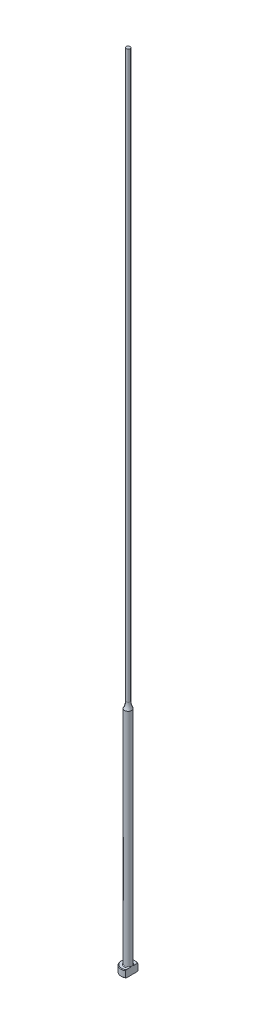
ISO-10303-21;
HEADER;
FILE_DESCRIPTION(('STEP AP214'),'2;1');
FILE_NAME('part.step','',(''),(''),'','','');
FILE_SCHEMA(('AUTOMOTIVE_DESIGN { 1 0 10303 214 1 1 1 1 }'));
ENDSEC;
DATA;
#1=APPLICATION_CONTEXT('core data for automotive mechanical design processes');
#2=APPLICATION_PROTOCOL_DEFINITION('international standard','automotive_design',2000,#1);
#3=PRODUCT_CONTEXT('',#1,'mechanical');
#4=PRODUCT('Part','Part','',(#3));
#5=PRODUCT_RELATED_PRODUCT_CATEGORY('part','',(#4));
#6=PRODUCT_DEFINITION_FORMATION('','',#4);
#7=PRODUCT_DEFINITION_CONTEXT('part definition',#1,'design');
#8=PRODUCT_DEFINITION('design','',#6,#7);
#9=PRODUCT_DEFINITION_SHAPE('','',#8);
#10=(LENGTH_UNIT() NAMED_UNIT(*) SI_UNIT(.MILLI.,.METRE.));
#11=(NAMED_UNIT(*) PLANE_ANGLE_UNIT() SI_UNIT($,.RADIAN.));
#12=(NAMED_UNIT(*) SI_UNIT($,.STERADIAN.) SOLID_ANGLE_UNIT());
#13=UNCERTAINTY_MEASURE_WITH_UNIT(LENGTH_MEASURE(1.E-05),#10,'distance_accuracy_value','');
#14=(GEOMETRIC_REPRESENTATION_CONTEXT(3) GLOBAL_UNCERTAINTY_ASSIGNED_CONTEXT((#13)) GLOBAL_UNIT_ASSIGNED_CONTEXT((#10,
#11,#12)) REPRESENTATION_CONTEXT('',''));
#15=CARTESIAN_POINT('',(0.,0.,0.));
#16=DIRECTION('',(0.,0.,1.));
#17=DIRECTION('',(1.,0.,0.));
#18=AXIS2_PLACEMENT_3D('',#15,#16,#17);
#19=CARTESIAN_POINT('',(-3.17499999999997,3.175,0.));
#20=DIRECTION('',(0.,1.,0.));
#21=DIRECTION('',(0.,0.,1.));
#22=AXIS2_PLACEMENT_3D('',#19,#20,#21);
#23=PLANE('',#22);
#24=CARTESIAN_POINT('',(0.,3.175,0.));
#25=DIRECTION('',(0.,1.,0.));
#26=DIRECTION('',(0.,0.,1.));
#27=AXIS2_PLACEMENT_3D('',#24,#25,#26);
#28=CIRCLE('',#27,2.92099999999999);
#29=CARTESIAN_POINT('',(1.58749999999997,3.175,-2.4519552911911));
#30=VERTEX_POINT('',#29);
#31=CARTESIAN_POINT('',(1.58749999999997,3.175,2.4519552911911));
#32=VERTEX_POINT('',#31);
#33=EDGE_CURVE('E105',#30,#32,#28,.T.);
#34=ORIENTED_EDGE('',*,*,#33,.T.);
#35=DIRECTION('',(0.,0.,1.));
#36=VECTOR('',#35,1.);
#37=CARTESIAN_POINT('',(1.58749999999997,3.17499999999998,2.74963065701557));
#38=LINE('',#37,#36);
#39=CARTESIAN_POINT('',(1.58749999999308,3.175,0.933255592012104));
#40=VERTEX_POINT('',#39);
#41=EDGE_CURVE('E126',#40,#32,#38,.T.);
#42=ORIENTED_EDGE('',*,*,#41,.F.);
#43=CARTESIAN_POINT('',(0.,3.175,0.));
#44=DIRECTION('',(0.,1.,0.));
#45=DIRECTION('',(0.,0.,1.));
#46=AXIS2_PLACEMENT_3D('',#43,#44,#45);
#47=CIRCLE('',#46,1.84149999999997);
#48=CARTESIAN_POINT('',(1.58749999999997,3.17500000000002,-0.933255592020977));
#49=VERTEX_POINT('',#48);
#50=EDGE_CURVE('E11',#40,#49,#47,.F.);
#51=ORIENTED_EDGE('',*,*,#50,.T.);
#52=EDGE_CURVE('E52',#30,#49,#38,.T.);
#53=ORIENTED_EDGE('',*,*,#52,.F.);
#54=EDGE_LOOP('',(#34,#42,#51,#53));
#55=FACE_BOUND('',#54,.T.);
#56=ADVANCED_FACE('F32',(#55),#23,.T.);
#57=CARTESIAN_POINT('',(0.,259.958771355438,0.));
#58=DIRECTION('',(0.,1.,0.));
#59=DIRECTION('',(0.,0.,1.));
#60=AXIS2_PLACEMENT_3D('',#57,#58,#59);
#61=CYLINDRICAL_SURFACE('',#60,3.17499999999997);
#62=CARTESIAN_POINT('',(0.,2.92100000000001,0.));
#63=DIRECTION('',(0.,1.,0.));
#64=DIRECTION('',(0.,0.,1.));
#65=AXIS2_PLACEMENT_3D('',#62,#63,#64);
#66=CIRCLE('',#65,3.17499999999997);
#67=CARTESIAN_POINT('',(1.58749999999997,2.92100000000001,2.74963065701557));
#68=VERTEX_POINT('',#67);
#69=CARTESIAN_POINT('',(1.58749999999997,2.92100000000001,-2.74963065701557));
#70=VERTEX_POINT('',#69);
#71=EDGE_CURVE('E98',#68,#70,#66,.F.);
#72=ORIENTED_EDGE('',*,*,#71,.T.);
#73=DIRECTION('',(0.,-1.,0.));
#74=VECTOR('',#73,1.);
#75=CARTESIAN_POINT('',(1.58749999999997,355.601,-2.74963065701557));
#76=LINE('',#75,#74);
#77=CARTESIAN_POINT('',(1.58749999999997,0.253999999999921,-2.74963065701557));
#78=VERTEX_POINT('',#77);
#79=EDGE_CURVE('E141',#70,#78,#76,.T.);
#80=ORIENTED_EDGE('',*,*,#79,.T.);
#81=CARTESIAN_POINT('',(0.,0.253999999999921,0.));
#82=DIRECTION('',(0.,-1.,0.));
#83=DIRECTION('',(0.,0.,-1.));
#84=AXIS2_PLACEMENT_3D('',#81,#82,#83);
#85=CIRCLE('',#84,3.17499999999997);
#86=CARTESIAN_POINT('',(1.58749999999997,0.253999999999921,2.74963065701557));
#87=VERTEX_POINT('',#86);
#88=EDGE_CURVE('E95',#78,#87,#85,.F.);
#89=ORIENTED_EDGE('',*,*,#88,.T.);
#90=DIRECTION('',(0.,-1.,0.));
#91=VECTOR('',#90,1.);
#92=CARTESIAN_POINT('',(1.58749999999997,355.601,2.74963065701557));
#93=LINE('',#92,#91);
#94=EDGE_CURVE('E88',#68,#87,#93,.T.);
#95=ORIENTED_EDGE('',*,*,#94,.F.);
#96=EDGE_LOOP('',(#72,#80,#89,#95));
#97=FACE_BOUND('',#96,.T.);
#98=ADVANCED_FACE('F191',(#97),#61,.T.);
#99=CARTESIAN_POINT('',(0.,0.,0.));
#100=DIRECTION('',(0.,-1.,0.));
#101=DIRECTION('',(0.,0.,-1.));
#102=AXIS2_PLACEMENT_3D('',#99,#100,#101);
#103=PLANE('',#102);
#104=CARTESIAN_POINT('',(0.,0.,0.));
#105=DIRECTION('',(0.,-1.,0.));
#106=DIRECTION('',(0.,0.,-1.));
#107=AXIS2_PLACEMENT_3D('',#104,#105,#106);
#108=CIRCLE('',#107,2.92100000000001);
#109=CARTESIAN_POINT('',(1.58749999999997,0.,2.45195529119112));
#110=VERTEX_POINT('',#109);
#111=CARTESIAN_POINT('',(1.58749999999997,0.,-2.45195529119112));
#112=VERTEX_POINT('',#111);
#113=EDGE_CURVE('E93',#110,#112,#108,.T.);
#114=ORIENTED_EDGE('',*,*,#113,.T.);
#115=DIRECTION('',(0.,0.,1.));
#116=VECTOR('',#115,1.);
#117=CARTESIAN_POINT('',(1.58749999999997,0.,2.74963065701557));
#118=LINE('',#117,#116);
#119=EDGE_CURVE('E78',#112,#110,#118,.T.);
#120=ORIENTED_EDGE('',*,*,#119,.T.);
#121=EDGE_LOOP('',(#114,#120));
#122=FACE_BOUND('',#121,.T.);
#123=ADVANCED_FACE('F97',(#122),#103,.T.);
#124=CARTESIAN_POINT('',(0.,3.17499999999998,0.));
#125=DIRECTION('',(0.,-1.,0.));
#126=DIRECTION('',(0.,0.,-1.));
#127=AXIS2_PLACEMENT_3D('',#124,#125,#126);
#128=CONICAL_SURFACE('',#127,2.92100000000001,0.785398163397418);
#129=ORIENTED_EDGE('',*,*,#71,.F.);
#130=CARTESIAN_POINT('',(1.58749999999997,-0.161620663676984,-6.0529050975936));
#131=CARTESIAN_POINT('',(1.58749999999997,-0.0288893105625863,-5.91567682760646));
#132=CARTESIAN_POINT('',(1.58749999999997,0.103699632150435,-5.77831035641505));
#133=CARTESIAN_POINT('',(1.58749999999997,0.368508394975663,-5.50321874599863));
#134=CARTESIAN_POINT('',(1.58749999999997,0.5007282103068,-5.3654936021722));
#135=CARTESIAN_POINT('',(1.58749999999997,0.764778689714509,-5.08953516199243));
#136=CARTESIAN_POINT('',(1.58749999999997,0.896609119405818,-4.95130164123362));
#137=CARTESIAN_POINT('',(1.58749999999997,1.15968706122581,-4.67428233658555));
#138=CARTESIAN_POINT('',(1.58749999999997,1.29093457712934,-4.5354965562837));
#139=CARTESIAN_POINT('',(1.58749999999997,1.55007705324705,-4.25997724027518));
#140=CARTESIAN_POINT('',(1.58749999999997,1.67798684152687,-4.12325766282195));
#141=CARTESIAN_POINT('',(1.58749999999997,1.9328486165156,-3.84892898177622));
#142=CARTESIAN_POINT('',(1.58749999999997,2.05980060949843,-3.71131988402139));
#143=CARTESIAN_POINT('',(1.58749999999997,2.31237508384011,-3.43493978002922));
#144=CARTESIAN_POINT('',(1.58749999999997,2.43799784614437,-3.29616903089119));
#145=CARTESIAN_POINT('',(1.58749999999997,2.68741369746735,-3.01699558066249));
#146=CARTESIAN_POINT('',(1.58749999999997,2.81120686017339,-2.8765929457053));
#147=CARTESIAN_POINT('',(1.58749999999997,3.00875865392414,-2.64816703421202));
#148=CARTESIAN_POINT('',(1.58749999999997,3.08336151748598,-2.56087478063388));
#149=CARTESIAN_POINT('',(1.58749999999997,3.23123871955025,-2.385154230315));
#150=CARTESIAN_POINT('',(1.58749999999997,3.30451292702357,-2.29672582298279));
#151=CARTESIAN_POINT('',(1.58749999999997,3.45004422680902,-2.11747400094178));
#152=CARTESIAN_POINT('',(1.58749999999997,3.52228237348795,-2.02663514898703));
#153=CARTESIAN_POINT('',(1.58749999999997,3.66423097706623,-1.84302524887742));
#154=CARTESIAN_POINT('',(1.58749999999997,3.73394203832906,-1.75025467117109));
#155=CARTESIAN_POINT('',(1.58749999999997,3.87080633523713,-1.56067475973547));
#156=CARTESIAN_POINT('',(1.58749999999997,3.93790459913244,-1.46382547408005));
#157=CARTESIAN_POINT('',(1.58749999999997,4.06669147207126,-1.26632594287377));
#158=CARTESIAN_POINT('',(1.58749999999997,4.12837264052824,-1.16567073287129));
#159=CARTESIAN_POINT('',(1.58749999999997,4.21402252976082,-1.01165766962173));
#160=CARTESIAN_POINT('',(1.58749999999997,4.2412792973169,-0.960142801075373));
#161=CARTESIAN_POINT('',(1.58749999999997,4.29309798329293,-0.85578092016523));
#162=CARTESIAN_POINT('',(1.58749999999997,4.3176594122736,-0.802933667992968));
#163=CARTESIAN_POINT('',(1.58749999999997,4.38614656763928,-0.642461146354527));
#164=CARTESIAN_POINT('',(1.58749999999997,4.42510149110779,-0.532518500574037));
#165=CARTESIAN_POINT('',(1.58749999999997,4.46726244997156,-0.367680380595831));
#166=CARTESIAN_POINT('',(1.58749999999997,4.47844427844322,-0.314802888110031));
#167=CARTESIAN_POINT('',(1.58749999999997,4.49576654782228,-0.208209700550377));
#168=CARTESIAN_POINT('',(1.58749999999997,4.50190743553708,-0.154494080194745));
#169=CARTESIAN_POINT('',(1.58749999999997,4.50871296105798,-0.0468792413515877));
#170=CARTESIAN_POINT('',(1.58749999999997,4.50939451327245,0.00701889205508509));
#171=CARTESIAN_POINT('',(1.58749999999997,4.5052767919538,0.114606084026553));
#172=CARTESIAN_POINT('',(1.58749999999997,4.5004770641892,0.16829512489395));
#173=CARTESIAN_POINT('',(1.58749999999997,4.48579689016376,0.274485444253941));
#174=CARTESIAN_POINT('',(1.58749999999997,4.47596081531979,0.326992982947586));
#175=CARTESIAN_POINT('',(1.58749999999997,4.4518180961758,0.430974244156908));
#176=CARTESIAN_POINT('',(1.58749999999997,4.43750969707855,0.482447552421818));
#177=CARTESIAN_POINT('',(1.58749999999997,4.40502489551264,0.58446088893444));
#178=CARTESIAN_POINT('',(1.58749999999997,4.38682724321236,0.634994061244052));
#179=CARTESIAN_POINT('',(1.58749999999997,4.34729308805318,0.734789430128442));
#180=CARTESIAN_POINT('',(1.58749999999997,4.32595722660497,0.784051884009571));
#181=CARTESIAN_POINT('',(1.58749999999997,4.25791922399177,0.93054934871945));
#182=CARTESIAN_POINT('',(1.58749999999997,4.20736047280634,1.02598802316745));
#183=CARTESIAN_POINT('',(1.58749999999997,4.09955451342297,1.21304313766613));
#184=CARTESIAN_POINT('',(1.58749999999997,4.04229912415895,1.30465471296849));
#185=CARTESIAN_POINT('',(1.58749999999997,3.92308746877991,1.48526211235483));
#186=CARTESIAN_POINT('',(1.58749999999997,3.86111349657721,1.57424615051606));
#187=CARTESIAN_POINT('',(1.58749999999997,3.73408621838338,1.74990003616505));
#188=CARTESIAN_POINT('',(1.58749999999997,3.66903444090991,1.83657099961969));
#189=CARTESIAN_POINT('',(1.58749999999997,3.53583371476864,2.009317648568));
#190=CARTESIAN_POINT('',(1.58749999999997,3.46765527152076,2.09537048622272));
#191=CARTESIAN_POINT('',(1.58749999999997,3.32960643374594,2.26611736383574));
#192=CARTESIAN_POINT('',(1.58749999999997,3.25973586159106,2.35081125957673));
#193=CARTESIAN_POINT('',(1.58749999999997,3.04858139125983,2.60290121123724));
#194=CARTESIAN_POINT('',(1.58749999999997,2.90542388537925,2.7687253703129));
#195=CARTESIAN_POINT('',(1.58749999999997,2.64069522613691,3.06970913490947));
#196=CARTESIAN_POINT('',(1.58749999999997,2.5195945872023,3.20528660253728));
#197=CARTESIAN_POINT('',(1.58749999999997,2.27590400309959,3.47510321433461));
#198=CARTESIAN_POINT('',(1.58749999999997,2.1533140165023,3.60934232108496));
#199=CARTESIAN_POINT('',(1.58749999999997,1.9069423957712,3.87695374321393));
#200=CARTESIAN_POINT('',(1.58749999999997,1.78315974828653,4.01032512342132));
#201=CARTESIAN_POINT('',(1.58749999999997,1.53478104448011,4.2763088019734));
#202=CARTESIAN_POINT('',(1.58749999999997,1.41018498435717,4.40892109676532));
#203=CARTESIAN_POINT('',(1.58749999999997,1.04574684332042,4.79499418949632));
#204=CARTESIAN_POINT('',(1.58749999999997,0.805076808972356,5.04767313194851));
#205=CARTESIAN_POINT('',(1.58749999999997,0.44312150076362,5.42550911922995));
#206=CARTESIAN_POINT('',(1.58749999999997,0.322378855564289,5.55118772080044));
#207=CARTESIAN_POINT('',(1.58749999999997,0.0805914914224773,5.8022520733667));
#208=CARTESIAN_POINT('',(1.58749999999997,-0.0404532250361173,5.92763782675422));
#209=CARTESIAN_POINT('',(1.58749999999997,-0.161620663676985,6.0529050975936));
#210=B_SPLINE_CURVE_WITH_KNOTS('',3,(#130,#131,#132,#133,#134,#135,#136,#137,#138,#139,#140,
#141,#142,#143,#144,#145,#146,#147,#148,#149,#150,#151,#152,#153,#154,#155,#156,#157,#158,#159,
#160,#161,#162,#163,#164,#165,#166,#167,#168,#169,#170,#171,#172,#173,#174,#175,#176,#177,#178,
#179,#180,#181,#182,#183,#184,#185,#186,#187,#188,#189,#190,#191,#192,#193,#194,#195,#196,#197,
#198,#199,#200,#201,#202,#203,#204,#205,#206,#207,#208,#209),.UNSPECIFIED.,.F.,.F.,(4,2,2,2,2,2,
2,2,2,2,2,2,2,2,2,2,2,2,2,2,2,2,2,2,2,2,2,2,2,2,2,2,2,2,2,2,2,2,2,4),(0.,0.572750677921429,
1.14550874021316,1.71856057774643,2.29160869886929,2.85328006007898,3.41494773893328,
3.97649423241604,4.53801804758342,4.88249307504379,5.2270018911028,5.57515326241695,
5.92322081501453,6.27657800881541,6.63041319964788,6.80518126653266,6.97998101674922,
7.32824262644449,7.49018491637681,7.65211285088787,7.81353889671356,7.97497832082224,
8.13501929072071,8.29512313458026,8.45612518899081,8.61709438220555,8.94062993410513,
9.26456495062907,9.58978187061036,9.91483894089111,10.2441741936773,10.5735441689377,
11.2306812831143,11.7760337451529,12.3214014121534,12.8672825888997,13.4131663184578,
14.4600164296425,14.9828595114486,15.505698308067),.UNSPECIFIED.);
#211=EDGE_CURVE('E118',#32,#68,#210,.T.);
#212=ORIENTED_EDGE('',*,*,#211,.F.);
#213=ORIENTED_EDGE('',*,*,#33,.F.);
#214=EDGE_CURVE('E117',#70,#30,#210,.T.);
#215=ORIENTED_EDGE('',*,*,#214,.F.);
#216=EDGE_LOOP('',(#129,#212,#213,#215));
#217=FACE_BOUND('',#216,.T.);
#218=ADVANCED_FACE('F162',(#217),#128,.T.);
#219=CARTESIAN_POINT('',(0.,0.253999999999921,0.));
#220=DIRECTION('',(0.,1.,0.));
#221=DIRECTION('',(0.,0.,1.));
#222=AXIS2_PLACEMENT_3D('',#219,#220,#221);
#223=CONICAL_SURFACE('',#222,3.17499999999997,0.785398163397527);
#224=ORIENTED_EDGE('',*,*,#88,.F.);
#225=CARTESIAN_POINT('',(1.58749999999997,3.33662066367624,6.0529050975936));
#226=CARTESIAN_POINT('',(1.58749999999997,3.20388931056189,5.91567682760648));
#227=CARTESIAN_POINT('',(1.58749999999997,3.07130036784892,5.7783103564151));
#228=CARTESIAN_POINT('',(1.58749999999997,2.80649160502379,5.50321874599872));
#229=CARTESIAN_POINT('',(1.58749999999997,2.6742717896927,5.36549360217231));
#230=CARTESIAN_POINT('',(1.58749999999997,2.41022131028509,5.08953516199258));
#231=CARTESIAN_POINT('',(1.58749999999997,2.27839088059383,4.95130164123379));
#232=CARTESIAN_POINT('',(1.58749999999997,2.01531293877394,4.67428233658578));
#233=CARTESIAN_POINT('',(1.58749999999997,1.88406542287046,4.53549655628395));
#234=CARTESIAN_POINT('',(1.58749999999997,1.62492294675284,4.25997724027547));
#235=CARTESIAN_POINT('',(1.58749999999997,1.49701315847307,4.12325766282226));
#236=CARTESIAN_POINT('',(1.58749999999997,1.24215138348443,3.84892898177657));
#237=CARTESIAN_POINT('',(1.58749999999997,1.11519939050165,3.71131988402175));
#238=CARTESIAN_POINT('',(1.58749999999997,0.862624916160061,3.43493978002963));
#239=CARTESIAN_POINT('',(1.58749999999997,0.737002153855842,3.29616903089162));
#240=CARTESIAN_POINT('',(1.58749999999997,0.487586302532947,3.01699558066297));
#241=CARTESIAN_POINT('',(1.58749999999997,0.363793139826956,2.8765929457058));
#242=CARTESIAN_POINT('',(1.58749999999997,0.166241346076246,2.64816703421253));
#243=CARTESIAN_POINT('',(1.58749999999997,0.0916384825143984,2.56087478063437));
#244=CARTESIAN_POINT('',(1.58749999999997,-0.0562387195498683,2.38515423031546));
#245=CARTESIAN_POINT('',(1.58749999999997,-0.129512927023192,2.29672582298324));
#246=CARTESIAN_POINT('',(1.58749999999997,-0.275044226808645,2.1174740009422));
#247=CARTESIAN_POINT('',(1.58749999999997,-0.347282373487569,2.02663514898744));
#248=CARTESIAN_POINT('',(1.58749999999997,-0.489230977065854,1.8430252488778));
#249=CARTESIAN_POINT('',(1.58749999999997,-0.558942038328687,1.75025467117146));
#250=CARTESIAN_POINT('',(1.58749999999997,-0.695806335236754,1.5606747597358));
#251=CARTESIAN_POINT('',(1.58749999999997,-0.762904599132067,1.46382547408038));
#252=CARTESIAN_POINT('',(1.58749999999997,-0.89169147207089,1.26632594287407));
#253=CARTESIAN_POINT('',(1.58749999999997,-0.953372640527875,1.16567073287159));
#254=CARTESIAN_POINT('',(1.58749999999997,-1.03902252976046,1.01165766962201));
#255=CARTESIAN_POINT('',(1.58749999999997,-1.06627929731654,0.960142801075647));
#256=CARTESIAN_POINT('',(1.58749999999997,-1.11809798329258,0.855780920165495));
#257=CARTESIAN_POINT('',(1.58749999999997,-1.14265941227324,0.802933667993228));
#258=CARTESIAN_POINT('',(1.58749999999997,-1.21114656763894,0.642461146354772));
#259=CARTESIAN_POINT('',(1.58749999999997,-1.25010149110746,0.532518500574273));
#260=CARTESIAN_POINT('',(1.58749999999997,-1.29226244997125,0.367680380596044));
#261=CARTESIAN_POINT('',(1.58749999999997,-1.30344427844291,0.314802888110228));
#262=CARTESIAN_POINT('',(1.58749999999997,-1.32076654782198,0.208209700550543));
#263=CARTESIAN_POINT('',(1.58749999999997,-1.32690743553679,0.154494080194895));
#264=CARTESIAN_POINT('',(1.58749999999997,-1.3337129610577,0.0468792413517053));
#265=CARTESIAN_POINT('',(1.58749999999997,-1.33439451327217,-0.00701889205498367));
#266=CARTESIAN_POINT('',(1.58749999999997,-1.33027679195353,-0.114606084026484));
#267=CARTESIAN_POINT('',(1.58749999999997,-1.32547706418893,-0.168295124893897));
#268=CARTESIAN_POINT('',(1.58749999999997,-1.31079689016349,-0.274485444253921));
#269=CARTESIAN_POINT('',(1.58749999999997,-1.30096081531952,-0.326992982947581));
#270=CARTESIAN_POINT('',(1.58749999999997,-1.27681809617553,-0.430974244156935));
#271=CARTESIAN_POINT('',(1.58749999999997,-1.26250969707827,-0.48244755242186));
#272=CARTESIAN_POINT('',(1.58749999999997,-1.23002489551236,-0.584460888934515));
#273=CARTESIAN_POINT('',(1.58749999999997,-1.21182724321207,-0.634994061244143));
#274=CARTESIAN_POINT('',(1.58749999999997,-1.17229308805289,-0.734789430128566));
#275=CARTESIAN_POINT('',(1.58749999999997,-1.15095722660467,-0.784051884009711));
#276=CARTESIAN_POINT('',(1.58749999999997,-1.08291922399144,-0.930549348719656));
#277=CARTESIAN_POINT('',(1.58749999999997,-1.03236047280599,-1.0259880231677));
#278=CARTESIAN_POINT('',(1.58749999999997,-0.924554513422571,-1.21304313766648));
#279=CARTESIAN_POINT('',(1.58749999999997,-0.867299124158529,-1.30465471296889));
#280=CARTESIAN_POINT('',(1.58749999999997,-0.748087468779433,-1.48526211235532));
#281=CARTESIAN_POINT('',(1.58749999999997,-0.686113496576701,-1.5742461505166));
#282=CARTESIAN_POINT('',(1.58749999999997,-0.559086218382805,-1.74990003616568));
#283=CARTESIAN_POINT('',(1.58749999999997,-0.494034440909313,-1.83657099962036));
#284=CARTESIAN_POINT('',(1.58749999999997,-0.360833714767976,-2.00931764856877));
#285=CARTESIAN_POINT('',(1.58749999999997,-0.292655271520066,-2.09537048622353));
#286=CARTESIAN_POINT('',(1.58749999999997,-0.154606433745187,-2.26611736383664));
#287=CARTESIAN_POINT('',(1.58749999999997,-0.0847358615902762,-2.35081125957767));
#288=CARTESIAN_POINT('',(1.58749999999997,0.126418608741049,-2.60290121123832));
#289=CARTESIAN_POINT('',(1.58749999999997,0.269576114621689,-2.76872537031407));
#290=CARTESIAN_POINT('',(1.58749999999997,0.534304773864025,-3.06970913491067));
#291=CARTESIAN_POINT('',(1.58749999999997,0.655405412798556,-3.20528660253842));
#292=CARTESIAN_POINT('',(1.58749999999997,0.899095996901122,-3.47510321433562));
#293=CARTESIAN_POINT('',(1.58749999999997,1.02168598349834,-3.60934232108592));
#294=CARTESIAN_POINT('',(1.58749999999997,1.26805760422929,-3.87695374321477));
#295=CARTESIAN_POINT('',(1.58749999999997,1.39184025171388,-4.0103251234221));
#296=CARTESIAN_POINT('',(1.58749999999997,1.64021895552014,-4.27630880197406));
#297=CARTESIAN_POINT('',(1.58749999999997,1.76481501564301,-4.40892109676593));
#298=CARTESIAN_POINT('',(1.58749999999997,2.12925315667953,-4.79499418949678));
#299=CARTESIAN_POINT('',(1.58749999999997,2.36992319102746,-5.04767313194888));
#300=CARTESIAN_POINT('',(1.58749999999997,2.73187849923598,-5.42550911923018));
#301=CARTESIAN_POINT('',(1.58749999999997,2.85262114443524,-5.55118772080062));
#302=CARTESIAN_POINT('',(1.58749999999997,3.09440850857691,-5.80225207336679));
#303=CARTESIAN_POINT('',(1.58749999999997,3.21545322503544,-5.92763782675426));
#304=CARTESIAN_POINT('',(1.58749999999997,3.33662066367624,-6.0529050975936));
#305=B_SPLINE_CURVE_WITH_KNOTS('',3,(#225,#226,#227,#228,#229,#230,#231,#232,#233,#234,#235,
#236,#237,#238,#239,#240,#241,#242,#243,#244,#245,#246,#247,#248,#249,#250,#251,#252,#253,#254,
#255,#256,#257,#258,#259,#260,#261,#262,#263,#264,#265,#266,#267,#268,#269,#270,#271,#272,#273,
#274,#275,#276,#277,#278,#279,#280,#281,#282,#283,#284,#285,#286,#287,#288,#289,#290,#291,#292,
#293,#294,#295,#296,#297,#298,#299,#300,#301,#302,#303,#304),.UNSPECIFIED.,.F.,.F.,(4,2,2,2,2,2,
2,2,2,2,2,2,2,2,2,2,2,2,2,2,2,2,2,2,2,2,2,2,2,2,2,2,2,2,2,2,2,2,2,4),(0.,0.572750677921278,
1.14550874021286,1.71856057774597,2.29160869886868,2.85328006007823,3.4149477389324,
3.97649423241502,4.53801804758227,4.88249307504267,5.22700189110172,5.5751532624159,
5.92322081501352,6.27657800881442,6.63041319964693,6.80518126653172,6.9799810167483,
7.3282426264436,7.49018491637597,7.65211285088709,7.81353889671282,7.97497832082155,
8.13501929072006,8.29512313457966,8.45612518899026,8.61709438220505,8.9406299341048,
9.2645649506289,9.58978187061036,9.91483894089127,10.2441741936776,10.5735441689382,
11.2306812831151,11.7760337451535,12.3214014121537,12.8672825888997,13.4131663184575,
14.4600164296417,14.9828595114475,15.5056983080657),.UNSPECIFIED.);
#306=EDGE_CURVE('E81',#112,#78,#305,.T.);
#307=ORIENTED_EDGE('',*,*,#306,.F.);
#308=ORIENTED_EDGE('',*,*,#113,.F.);
#309=EDGE_CURVE('E84',#87,#110,#305,.T.);
#310=ORIENTED_EDGE('',*,*,#309,.F.);
#311=EDGE_LOOP('',(#224,#307,#308,#310));
#312=FACE_BOUND('',#311,.T.);
#313=ADVANCED_FACE('F92',(#312),#223,.T.);
#314=CARTESIAN_POINT('',(0.,3.42900000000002,0.));
#315=DIRECTION('',(0.,1.,0.));
#316=DIRECTION('',(0.,0.,1.));
#317=AXIS2_PLACEMENT_3D('',#314,#315,#316);
#318=TOROIDAL_SURFACE('',#317,1.84149999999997,0.254);
#319=CARTESIAN_POINT('',(1.58749999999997,3.42900000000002,0.));
#320=CARTESIAN_POINT('',(1.58749999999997,3.42899942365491,-1.9220514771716E-10));
#321=CARTESIAN_POINT('',(1.58749999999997,3.42899884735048,-1.2261161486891E-07));
#322=CARTESIAN_POINT('',(1.58749999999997,3.42899773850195,-5.09676365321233E-07));
#323=CARTESIAN_POINT('',(1.58749999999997,3.42899720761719,-7.78176328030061E-07));
#324=CARTESIAN_POINT('',(1.58749999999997,3.42899614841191,-1.42307272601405E-06));
#325=CARTESIAN_POINT('',(1.58749999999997,3.42899562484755,-1.80713867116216E-06));
#326=CARTESIAN_POINT('',(1.58749999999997,3.42899463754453,-2.63494846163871E-06));
#327=CARTESIAN_POINT('',(1.58749999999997,3.42899417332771,-3.07814756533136E-06));
#328=CARTESIAN_POINT('',(1.58749999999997,3.42899261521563,-4.66897357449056E-06));
#329=CARTESIAN_POINT('',(1.58749999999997,3.42899159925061,-5.89404908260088E-06));
#330=CARTESIAN_POINT('',(1.58749999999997,3.42898979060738,-8.42427511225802E-06));
#331=CARTESIAN_POINT('',(1.58749999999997,3.42898899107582,-9.7248057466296E-06));
#332=CARTESIAN_POINT('',(1.58749999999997,3.42898598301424,-1.48060601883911E-05));
#333=CARTESIAN_POINT('',(1.58749999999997,3.42898393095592,-1.86838281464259E-05));
#334=CARTESIAN_POINT('',(1.58749999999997,3.42898057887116,-2.63261117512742E-05));
#335=CARTESIAN_POINT('',(1.58749999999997,3.42897922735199,-3.00687417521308E-05));
#336=CARTESIAN_POINT('',(1.58749999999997,3.42897347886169,-4.60276298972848E-05));
#337=CARTESIAN_POINT('',(1.58749999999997,3.42896911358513,-5.8247019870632E-05));
#338=CARTESIAN_POINT('',(1.58749999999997,3.42896211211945,-8.11070097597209E-05));
#339=CARTESIAN_POINT('',(1.58749999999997,3.42895931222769,-9.16953114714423E-05));
#340=CARTESIAN_POINT('',(1.58749999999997,3.42893712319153,-0.000168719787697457));
#341=CARTESIAN_POINT('',(1.58749999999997,3.42890881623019,-0.000232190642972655));
#342=CARTESIAN_POINT('',(1.58749999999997,3.42880276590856,-0.000479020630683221));
#343=CARTESIAN_POINT('',(1.58749999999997,3.42873165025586,-0.00066443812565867));
#344=CARTESIAN_POINT('',(1.58749999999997,3.42845137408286,-0.0013844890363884));
#345=CARTESIAN_POINT('',(1.58749999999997,3.42823526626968,-0.00191701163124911));
#346=CARTESIAN_POINT('',(1.58749999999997,3.42735449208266,-0.00409774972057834));
#347=CARTESIAN_POINT('',(1.58749999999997,3.42669768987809,-0.00574830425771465));
#348=CARTESIAN_POINT('',(1.58749999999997,3.4174405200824,-0.0289985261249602));
#349=CARTESIAN_POINT('',(1.58749999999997,3.40878325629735,-0.0505816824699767));
#350=CARTESIAN_POINT('',(1.58749999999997,3.39189297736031,-0.0929947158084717));
#351=CARTESIAN_POINT('',(1.58749999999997,3.38365605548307,-0.11382315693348));
#352=CARTESIAN_POINT('',(1.58749999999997,3.36635393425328,-0.157956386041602));
#353=CARTESIAN_POINT('',(1.58749999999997,3.35730391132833,-0.181267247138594));
#354=CARTESIAN_POINT('',(1.58749999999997,3.33936775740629,-0.228222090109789));
#355=CARTESIAN_POINT('',(1.58749999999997,3.33048420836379,-0.25186705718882));
#356=CARTESIAN_POINT('',(1.58749999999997,3.30894496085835,-0.310512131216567));
#357=CARTESIAN_POINT('',(1.58749999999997,3.29649449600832,-0.345588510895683));
#358=CARTESIAN_POINT('',(1.58749999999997,3.27296975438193,-0.415278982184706));
#359=CARTESIAN_POINT('',(1.58749999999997,3.26186987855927,-0.449884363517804));
#360=CARTESIAN_POINT('',(1.58749999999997,3.2395832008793,-0.524471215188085));
#361=CARTESIAN_POINT('',(1.58749999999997,3.22860862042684,-0.564517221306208));
#362=CARTESIAN_POINT('',(1.58749999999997,3.20902534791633,-0.645529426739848));
#363=CARTESIAN_POINT('',(1.58749999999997,3.20043582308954,-0.686500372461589));
#364=CARTESIAN_POINT('',(1.58749999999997,3.18611712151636,-0.771546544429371));
#365=CARTESIAN_POINT('',(1.58749999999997,3.18059550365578,-0.815658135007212));
#366=CARTESIAN_POINT('',(1.58749999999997,3.17455396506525,-0.904117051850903));
#367=CARTESIAN_POINT('',(1.58749999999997,3.17401361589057,-0.948462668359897));
#368=CARTESIAN_POINT('',(1.58749999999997,3.17898948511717,-1.02531896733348));
#369=CARTESIAN_POINT('',(1.58749999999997,3.1829739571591,-1.05792141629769));
#370=CARTESIAN_POINT('',(1.58749999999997,3.19569167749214,-1.12184393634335));
#371=CARTESIAN_POINT('',(1.58749999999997,3.20436049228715,-1.1531753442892));
#372=CARTESIAN_POINT('',(1.58749999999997,3.22236152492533,-1.19946468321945));
#373=CARTESIAN_POINT('',(1.58749999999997,3.2295150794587,-1.21526783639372));
#374=CARTESIAN_POINT('',(1.58749999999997,3.24587062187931,-1.24583726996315));
#375=CARTESIAN_POINT('',(1.58749999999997,3.25507530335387,-1.26060215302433));
#376=CARTESIAN_POINT('',(1.58749999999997,3.27378481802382,-1.28575815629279));
#377=CARTESIAN_POINT('',(1.58749999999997,3.28289001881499,-1.29644383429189));
#378=CARTESIAN_POINT('',(1.58749999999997,3.30268460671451,-1.31623154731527));
#379=CARTESIAN_POINT('',(1.58749999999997,3.31337067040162,-1.32533681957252));
#380=CARTESIAN_POINT('',(1.58749999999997,3.33349977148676,-1.33941140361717));
#381=CARTESIAN_POINT('',(1.58749999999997,3.34261446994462,-1.34484814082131));
#382=CARTESIAN_POINT('',(1.58749999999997,3.36161455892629,-1.35416329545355));
#383=CARTESIAN_POINT('',(1.58749999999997,3.37149946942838,-1.35804267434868));
#384=CARTESIAN_POINT('',(1.58749999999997,3.39188678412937,-1.36398436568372));
#385=CARTESIAN_POINT('',(1.58749999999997,3.40239309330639,-1.36603350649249));
#386=CARTESIAN_POINT('',(1.58749999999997,3.42360372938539,-1.3680840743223));
#387=CARTESIAN_POINT('',(1.58749999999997,3.43430795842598,-1.36808648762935));
#388=CARTESIAN_POINT('',(1.58749999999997,3.45433283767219,-1.36616208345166));
#389=CARTESIAN_POINT('',(1.58749999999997,3.46367506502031,-1.36444960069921));
#390=CARTESIAN_POINT('',(1.58749999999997,3.48195519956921,-1.35953338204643));
#391=CARTESIAN_POINT('',(1.58749999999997,3.49089304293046,-1.3563294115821));
#392=CARTESIAN_POINT('',(1.58749999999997,3.50850302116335,-1.34848006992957));
#393=CARTESIAN_POINT('',(1.58749999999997,3.5171531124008,-1.34378578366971));
#394=CARTESIAN_POINT('',(1.58749999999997,3.53371257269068,-1.33324445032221));
#395=CARTESIAN_POINT('',(1.58749999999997,3.54162163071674,-1.32739692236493));
#396=CARTESIAN_POINT('',(1.58749999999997,3.56107121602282,-1.31107304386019));
#397=CARTESIAN_POINT('',(1.58749999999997,3.57202221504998,-1.29989286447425));
#398=CARTESIAN_POINT('',(1.58749999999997,3.59202509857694,-1.27593566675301));
#399=CARTESIAN_POINT('',(1.58749999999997,3.60107086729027,-1.26315370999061));
#400=CARTESIAN_POINT('',(1.58749999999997,3.62186023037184,-1.22930733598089));
#401=CARTESIAN_POINT('',(1.58749999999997,3.63240584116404,-1.20751096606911));
#402=CARTESIAN_POINT('',(1.58749999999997,3.65004643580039,-1.16266144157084));
#403=CARTESIAN_POINT('',(1.58749999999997,3.65714435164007,-1.13960937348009));
#404=CARTESIAN_POINT('',(1.58749999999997,3.67265428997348,-1.07603916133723));
#405=CARTESIAN_POINT('',(1.58749999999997,3.67834921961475,-1.03486686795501));
#406=CARTESIAN_POINT('',(1.58749999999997,3.68382880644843,-0.951558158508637));
#407=CARTESIAN_POINT('',(1.58749999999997,3.68350976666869,-0.909417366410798));
#408=CARTESIAN_POINT('',(1.58749999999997,3.67745397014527,-0.811383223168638));
#409=CARTESIAN_POINT('',(1.58749999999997,3.66993873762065,-0.755610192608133));
#410=CARTESIAN_POINT('',(1.58749999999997,3.64933373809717,-0.644937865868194));
#411=CARTESIAN_POINT('',(1.58749999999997,3.63621897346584,-0.59004364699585));
#412=CARTESIAN_POINT('',(1.58749999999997,3.60740922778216,-0.485757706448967));
#413=CARTESIAN_POINT('',(1.58749999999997,3.59201096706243,-0.436281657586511));
#414=CARTESIAN_POINT('',(1.58749999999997,3.55922497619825,-0.338551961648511));
#415=CARTESIAN_POINT('',(1.58749999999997,3.5418584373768,-0.290291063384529));
#416=CARTESIAN_POINT('',(1.58749999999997,3.51760237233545,-0.225557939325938));
#417=CARTESIAN_POINT('',(1.58749999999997,3.51126413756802,-0.208874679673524));
#418=CARTESIAN_POINT('',(1.58749999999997,3.49830042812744,-0.17512392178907));
#419=CARTESIAN_POINT('',(1.58749999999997,3.49167176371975,-0.158057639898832));
#420=CARTESIAN_POINT('',(1.58749999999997,3.47585523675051,-0.117638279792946));
#421=CARTESIAN_POINT('',(1.58749999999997,3.46662970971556,-0.0943002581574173));
#422=CARTESIAN_POINT('',(1.58749999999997,3.44889695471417,-0.0497824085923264));
#423=CARTESIAN_POINT('',(1.58749999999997,3.44040039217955,-0.028598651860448));
#424=CARTESIAN_POINT('',(1.58749999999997,3.43130364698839,-0.00575168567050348));
#425=CARTESIAN_POINT('',(1.58749999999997,3.43064818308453,-0.00410451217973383));
#426=CARTESIAN_POINT('',(1.58749999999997,3.42976776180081,-0.00192459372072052));
#427=CARTESIAN_POINT('',(1.58749999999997,3.42955062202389,-0.00138952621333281));
#428=CARTESIAN_POINT('',(1.58749999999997,3.42926908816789,-0.000666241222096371));
#429=CARTESIAN_POINT('',(1.58749999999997,3.42919771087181,-0.000480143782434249));
#430=CARTESIAN_POINT('',(1.58749999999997,3.42909131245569,-0.000232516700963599));
#431=CARTESIAN_POINT('',(1.58749999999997,3.42906294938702,-0.000168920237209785));
#432=CARTESIAN_POINT('',(1.58749999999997,3.42904072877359,-9.17527162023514E-05));
#433=CARTESIAN_POINT('',(1.58749999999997,3.42903792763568,-8.11550293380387E-05));
#434=CARTESIAN_POINT('',(1.58749999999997,3.42903091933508,-5.82743948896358E-05));
#435=CARTESIAN_POINT('',(1.58749999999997,3.42902654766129,-4.60440001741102E-05));
#436=CARTESIAN_POINT('',(1.58749999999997,3.42902079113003,-3.00727682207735E-05));
#437=CARTESIAN_POINT('',(1.58749999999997,3.42901943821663,-2.63286807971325E-05));
#438=CARTESIAN_POINT('',(1.58749999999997,3.42901608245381,-1.86836529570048E-05));
#439=CARTESIAN_POINT('',(1.58749999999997,3.4290140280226,-1.48046517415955E-05));
#440=CARTESIAN_POINT('',(1.58749999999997,3.42901101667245,-9.72223943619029E-06));
#441=CARTESIAN_POINT('',(1.58749999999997,3.42901021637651,-8.42159649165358E-06));
#442=CARTESIAN_POINT('',(1.58749999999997,3.42900840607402,-5.89129729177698E-06));
#443=CARTESIAN_POINT('',(1.58749999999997,3.42900738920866,-4.66626867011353E-06));
#444=CARTESIAN_POINT('',(1.58749999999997,3.42900582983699,-3.07568803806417E-06));
#445=CARTESIAN_POINT('',(1.58749999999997,3.42900536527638,-2.63259565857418E-06));
#446=CARTESIAN_POINT('',(1.58749999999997,3.4290043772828,-1.80506085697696E-06));
#447=CARTESIAN_POINT('',(1.58749999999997,3.42900385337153,-1.42116387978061E-06));
#448=CARTESIAN_POINT('',(1.58749999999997,3.42900279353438,-7.76675643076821E-07));
#449=CARTESIAN_POINT('',(1.58749999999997,3.42900226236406,-5.08406487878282E-07));
#450=CARTESIAN_POINT('',(1.58749999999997,3.42900115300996,-1.21901887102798E-07));
#451=CARTESIAN_POINT('',(1.58749999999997,3.42900057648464,1.92251677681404E-10));
#452=CARTESIAN_POINT('',(1.58749999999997,3.42900000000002,0.));
#453=B_SPLINE_CURVE_WITH_KNOTS('',3,(#319,#320,#321,#322,#323,#324,#325,#326,#327,#328,#329,
#330,#331,#332,#333,#334,#335,#336,#337,#338,#339,#340,#341,#342,#343,#344,#345,#346,#347,#348,
#349,#350,#351,#352,#353,#354,#355,#356,#357,#358,#359,#360,#361,#362,#363,#364,#365,#366,#367,
#368,#369,#370,#371,#372,#373,#374,#375,#376,#377,#378,#379,#380,#381,#382,#383,#384,#385,#386,
#387,#388,#389,#390,#391,#392,#393,#394,#395,#396,#397,#398,#399,#400,#401,#402,#403,#404,#405,
#406,#407,#408,#409,#410,#411,#412,#413,#414,#415,#416,#417,#418,#419,#420,#421,#422,#423,#424,
#425,#426,#427,#428,#429,#430,#431,#432,#433,#434,#435,#436,#437,#438,#439,#440,#441,#442,#443,
#444,#445,#446,#447,#448,#449,#450,#451,#452),.UNSPECIFIED.,.T.,.F.,(4,2,2,2,2,2,2,2,2,2,2,2,2,
2,2,2,2,2,2,2,2,2,2,2,2,2,2,2,2,2,2,2,2,2,2,2,2,2,2,2,2,2,2,2,2,2,2,2,2,2,2,2,2,2,2,2,2,2,2,2,2,
2,2,2,2,2,4),(0.,1.72815458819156E-06,3.50429255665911E-06,5.44431004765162E-06,
7.3675525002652E-06,1.2119089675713E-05,1.66953775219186E-05,2.98160400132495E-05,
4.17409564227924E-05,8.0660475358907E-05,0.000113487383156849,0.000321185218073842,
0.000917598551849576,0.00264089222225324,0.00797105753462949,0.0777276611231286,
0.144923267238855,0.219939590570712,0.295714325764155,0.407362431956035,0.516367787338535,
0.640878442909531,0.766362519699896,0.899536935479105,1.03216495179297,1.13045740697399,
1.22743103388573,1.27935899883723,1.33135556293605,1.37333248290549,1.41522237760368,
1.44693946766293,1.47863694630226,1.51056074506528,1.54246916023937,1.57083210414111,
1.59919951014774,1.62861579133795,1.65804436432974,1.70472658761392,1.75155645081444,
1.82378709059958,1.89595619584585,2.01995471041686,2.1460932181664,2.31447224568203,
2.48361094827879,2.6389891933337,2.79283011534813,2.84637031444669,2.9012946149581,
2.97658236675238,3.04504771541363,3.05036697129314,3.05209849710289,3.05269709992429,
3.05290520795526,3.05293806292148,3.05297701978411,3.05298895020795,3.05300207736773,
3.05300665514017,3.0530114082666,3.05301333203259,3.05301527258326,3.05301704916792,
3.05301877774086),.UNSPECIFIED.);
#454=CARTESIAN_POINT('',(1.58749999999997,3.42900000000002,0.));
#455=VERTEX_POINT('',#454);
#456=EDGE_CURVE('E47',#455,#49,#453,.T.);
#457=ORIENTED_EDGE('',*,*,#456,.T.);
#458=ORIENTED_EDGE('',*,*,#50,.F.);
#459=CARTESIAN_POINT('',(1.58749999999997,3.42900000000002,0.));
#460=CARTESIAN_POINT('',(1.58749999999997,3.42900057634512,1.9220512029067E-10));
#461=CARTESIAN_POINT('',(1.58749999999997,3.42900115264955,1.22611614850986E-07));
#462=CARTESIAN_POINT('',(1.58749999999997,3.42900226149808,5.09676365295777E-07));
#463=CARTESIAN_POINT('',(1.58749999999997,3.42900279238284,7.78176328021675E-07));
#464=CARTESIAN_POINT('',(1.58749999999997,3.42900385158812,1.42307272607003E-06));
#465=CARTESIAN_POINT('',(1.58749999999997,3.42900437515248,1.80713867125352E-06));
#466=CARTESIAN_POINT('',(1.58749999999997,3.4290053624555,2.63494846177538E-06));
#467=CARTESIAN_POINT('',(1.58749999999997,3.42900582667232,3.0781475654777E-06));
#468=CARTESIAN_POINT('',(1.58749999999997,3.4290073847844,4.66897357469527E-06));
#469=CARTESIAN_POINT('',(1.58749999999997,3.42900840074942,5.89404908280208E-06));
#470=CARTESIAN_POINT('',(1.58749999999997,3.42901020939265,8.42427511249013E-06));
#471=CARTESIAN_POINT('',(1.58749999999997,3.42901100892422,9.72480574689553E-06));
#472=CARTESIAN_POINT('',(1.58749999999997,3.42901401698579,1.48060601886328E-05));
#473=CARTESIAN_POINT('',(1.58749999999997,3.42901606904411,1.86838281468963E-05));
#474=CARTESIAN_POINT('',(1.58749999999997,3.42901942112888,2.63261117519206E-05));
#475=CARTESIAN_POINT('',(1.58749999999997,3.42902077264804,3.00687417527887E-05));
#476=CARTESIAN_POINT('',(1.58749999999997,3.42902652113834,4.60276298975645E-05));
#477=CARTESIAN_POINT('',(1.58749999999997,3.4290308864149,5.82470198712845E-05));
#478=CARTESIAN_POINT('',(1.58749999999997,3.42903788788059,8.11070097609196E-05));
#479=CARTESIAN_POINT('',(1.58749999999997,3.42904068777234,9.16953114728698E-05));
#480=CARTESIAN_POINT('',(1.58749999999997,3.4290628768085,0.000168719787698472));
#481=CARTESIAN_POINT('',(1.58749999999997,3.42909118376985,0.000232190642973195));
#482=CARTESIAN_POINT('',(1.58749999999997,3.42919723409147,0.000479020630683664));
#483=CARTESIAN_POINT('',(1.58749999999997,3.42926834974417,0.000664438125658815));
#484=CARTESIAN_POINT('',(1.58749999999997,3.42954862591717,0.00138448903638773));
#485=CARTESIAN_POINT('',(1.58749999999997,3.42976473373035,0.00191701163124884));
#486=CARTESIAN_POINT('',(1.58749999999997,3.43064550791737,0.00409774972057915));
#487=CARTESIAN_POINT('',(1.58749999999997,3.43130231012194,0.00574830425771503));
#488=CARTESIAN_POINT('',(1.58749999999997,3.44055947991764,0.0289985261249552));
#489=CARTESIAN_POINT('',(1.58749999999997,3.44921674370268,0.0505816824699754));
#490=CARTESIAN_POINT('',(1.58749999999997,3.46610702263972,0.0929947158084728));
#491=CARTESIAN_POINT('',(1.58749999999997,3.47434394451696,0.11382315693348));
#492=CARTESIAN_POINT('',(1.58749999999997,3.49164606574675,0.157956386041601));
#493=CARTESIAN_POINT('',(1.58749999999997,3.5006960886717,0.181267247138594));
#494=CARTESIAN_POINT('',(1.58749999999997,3.51863224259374,0.228222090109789));
#495=CARTESIAN_POINT('',(1.58749999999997,3.52751579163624,0.25186705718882));
#496=CARTESIAN_POINT('',(1.58749999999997,3.54905503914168,0.310512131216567));
#497=CARTESIAN_POINT('',(1.58749999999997,3.56150550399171,0.345588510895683));
#498=CARTESIAN_POINT('',(1.58749999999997,3.5850302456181,0.415278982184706));
#499=CARTESIAN_POINT('',(1.58749999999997,3.59613012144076,0.449884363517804));
#500=CARTESIAN_POINT('',(1.58749999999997,3.61841679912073,0.524471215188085));
#501=CARTESIAN_POINT('',(1.58749999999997,3.62939137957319,0.564517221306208));
#502=CARTESIAN_POINT('',(1.58749999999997,3.6489746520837,0.645529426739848));
#503=CARTESIAN_POINT('',(1.58749999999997,3.65756417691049,0.686500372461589));
#504=CARTESIAN_POINT('',(1.58749999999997,3.67188287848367,0.771546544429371));
#505=CARTESIAN_POINT('',(1.58749999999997,3.67740449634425,0.815658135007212));
#506=CARTESIAN_POINT('',(1.58749999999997,3.68344603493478,0.904117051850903));
#507=CARTESIAN_POINT('',(1.58749999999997,3.68398638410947,0.948462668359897));
#508=CARTESIAN_POINT('',(1.58749999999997,3.67901051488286,1.02531896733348));
#509=CARTESIAN_POINT('',(1.58749999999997,3.67502604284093,1.05792141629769));
#510=CARTESIAN_POINT('',(1.58749999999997,3.66230832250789,1.12184393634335));
#511=CARTESIAN_POINT('',(1.58749999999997,3.65363950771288,1.1531753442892));
#512=CARTESIAN_POINT('',(1.58749999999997,3.6356384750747,1.19946468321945));
#513=CARTESIAN_POINT('',(1.58749999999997,3.62848492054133,1.21526783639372));
#514=CARTESIAN_POINT('',(1.58749999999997,3.61212937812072,1.24583726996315));
#515=CARTESIAN_POINT('',(1.58749999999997,3.60292469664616,1.26060215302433));
#516=CARTESIAN_POINT('',(1.58749999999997,3.58421518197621,1.28575815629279));
#517=CARTESIAN_POINT('',(1.58749999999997,3.57510998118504,1.29644383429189));
#518=CARTESIAN_POINT('',(1.58749999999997,3.55531539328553,1.31623154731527));
#519=CARTESIAN_POINT('',(1.58749999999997,3.54462932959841,1.32533681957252));
#520=CARTESIAN_POINT('',(1.58749999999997,3.52450022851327,1.33941140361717));
#521=CARTESIAN_POINT('',(1.58749999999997,3.51538553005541,1.34484814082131));
#522=CARTESIAN_POINT('',(1.58749999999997,3.49638544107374,1.35416329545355));
#523=CARTESIAN_POINT('',(1.58749999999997,3.48650053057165,1.35804267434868));
#524=CARTESIAN_POINT('',(1.58749999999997,3.46611321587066,1.36398436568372));
#525=CARTESIAN_POINT('',(1.58749999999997,3.45560690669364,1.36603350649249));
#526=CARTESIAN_POINT('',(1.58749999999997,3.43439627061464,1.3680840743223));
#527=CARTESIAN_POINT('',(1.58749999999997,3.42369204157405,1.36808648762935));
#528=CARTESIAN_POINT('',(1.58749999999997,3.40366716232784,1.36616208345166));
#529=CARTESIAN_POINT('',(1.58749999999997,3.39432493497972,1.36444960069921));
#530=CARTESIAN_POINT('',(1.58749999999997,3.37604480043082,1.35953338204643));
#531=CARTESIAN_POINT('',(1.58749999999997,3.36710695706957,1.3563294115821));
#532=CARTESIAN_POINT('',(1.58749999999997,3.34949697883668,1.34848006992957));
#533=CARTESIAN_POINT('',(1.58749999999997,3.34084688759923,1.34378578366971));
#534=CARTESIAN_POINT('',(1.58749999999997,3.32428742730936,1.33324445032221));
#535=CARTESIAN_POINT('',(1.58749999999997,3.31637836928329,1.32739692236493));
#536=CARTESIAN_POINT('',(1.58749999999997,3.29692878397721,1.31107304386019));
#537=CARTESIAN_POINT('',(1.58749999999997,3.28597778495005,1.29989286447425));
#538=CARTESIAN_POINT('',(1.58749999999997,3.26597490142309,1.27593566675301));
#539=CARTESIAN_POINT('',(1.58749999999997,3.25692913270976,1.26315370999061));
#540=CARTESIAN_POINT('',(1.58749999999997,3.23613976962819,1.22930733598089));
#541=CARTESIAN_POINT('',(1.58749999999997,3.22559415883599,1.20751096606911));
#542=CARTESIAN_POINT('',(1.58749999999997,3.20795356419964,1.16266144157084));
#543=CARTESIAN_POINT('',(1.58749999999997,3.20085564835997,1.13960937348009));
#544=CARTESIAN_POINT('',(1.58749999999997,3.18534571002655,1.07603916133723));
#545=CARTESIAN_POINT('',(1.58749999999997,3.17965078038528,1.03486686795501));
#546=CARTESIAN_POINT('',(1.58749999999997,3.1741711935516,0.951558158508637));
#547=CARTESIAN_POINT('',(1.58749999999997,3.17449023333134,0.909417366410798));
#548=CARTESIAN_POINT('',(1.58749999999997,3.18054602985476,0.811383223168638));
#549=CARTESIAN_POINT('',(1.58749999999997,3.18806126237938,0.755610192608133));
#550=CARTESIAN_POINT('',(1.58749999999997,3.20866626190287,0.644937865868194));
#551=CARTESIAN_POINT('',(1.58749999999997,3.2217810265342,0.59004364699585));
#552=CARTESIAN_POINT('',(1.58749999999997,3.25059077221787,0.485757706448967));
#553=CARTESIAN_POINT('',(1.58749999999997,3.2659890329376,0.43628165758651));
#554=CARTESIAN_POINT('',(1.58749999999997,3.29877502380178,0.338551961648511));
#555=CARTESIAN_POINT('',(1.58749999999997,3.31614156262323,0.290291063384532));
#556=CARTESIAN_POINT('',(1.58749999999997,3.34039762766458,0.225557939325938));
#557=CARTESIAN_POINT('',(1.58749999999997,3.346735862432,0.208874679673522));
#558=CARTESIAN_POINT('',(1.58749999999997,3.35969957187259,0.175123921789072));
#559=CARTESIAN_POINT('',(1.58749999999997,3.3663282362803,0.15805763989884));
#560=CARTESIAN_POINT('',(1.58749999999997,3.3821447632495,0.117638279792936));
#561=CARTESIAN_POINT('',(1.58749999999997,3.39137029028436,0.0943002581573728));
#562=CARTESIAN_POINT('',(1.58749999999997,3.40910304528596,0.0497824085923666));
#563=CARTESIAN_POINT('',(1.58749999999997,3.41759960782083,0.0285986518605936));
#564=CARTESIAN_POINT('',(1.58749999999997,3.42669635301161,0.00575168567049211));
#565=CARTESIAN_POINT('',(1.58749999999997,3.42735181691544,0.00410451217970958));
#566=CARTESIAN_POINT('',(1.58749999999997,3.42823223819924,0.00192459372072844));
#567=CARTESIAN_POINT('',(1.58749999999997,3.42844937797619,0.00138952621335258));
#568=CARTESIAN_POINT('',(1.58749999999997,3.42873091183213,0.000666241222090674));
#569=CARTESIAN_POINT('',(1.58749999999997,3.42880228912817,0.000480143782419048));
#570=CARTESIAN_POINT('',(1.58749999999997,3.42890868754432,0.000232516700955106));
#571=CARTESIAN_POINT('',(1.58749999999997,3.42893705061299,0.000168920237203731));
#572=CARTESIAN_POINT('',(1.58749999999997,3.42895927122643,9.17527161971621E-05));
#573=CARTESIAN_POINT('',(1.58749999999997,3.42896207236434,8.1155029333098E-05));
#574=CARTESIAN_POINT('',(1.58749999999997,3.42896908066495,5.82743948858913E-05));
#575=CARTESIAN_POINT('',(1.58749999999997,3.42897345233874,4.60440001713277E-05));
#576=CARTESIAN_POINT('',(1.58749999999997,3.42897920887,3.00727682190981E-05));
#577=CARTESIAN_POINT('',(1.58749999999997,3.42898056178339,2.63286807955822E-05));
#578=CARTESIAN_POINT('',(1.58749999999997,3.42898391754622,1.86836529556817E-05));
#579=CARTESIAN_POINT('',(1.58749999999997,3.42898597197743,1.48046517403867E-05));
#580=CARTESIAN_POINT('',(1.58749999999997,3.42898898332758,9.72223943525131E-06));
#581=CARTESIAN_POINT('',(1.58749999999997,3.42898978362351,8.42159649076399E-06));
#582=CARTESIAN_POINT('',(1.58749999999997,3.42899159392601,5.89129729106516E-06));
#583=CARTESIAN_POINT('',(1.58749999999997,3.42899261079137,4.66626866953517E-06));
#584=CARTESIAN_POINT('',(1.58749999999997,3.42899417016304,3.0756880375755E-06));
#585=CARTESIAN_POINT('',(1.58749999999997,3.42899463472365,2.63259565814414E-06));
#586=CARTESIAN_POINT('',(1.58749999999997,3.42899562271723,1.80506085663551E-06));
#587=CARTESIAN_POINT('',(1.58749999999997,3.42899614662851,1.42116387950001E-06));
#588=CARTESIAN_POINT('',(1.58749999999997,3.42899720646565,7.7667564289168E-07));
#589=CARTESIAN_POINT('',(1.58749999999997,3.42899773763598,5.0840648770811E-07));
#590=CARTESIAN_POINT('',(1.58749999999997,3.42899884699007,1.21901887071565E-07));
#591=CARTESIAN_POINT('',(1.58749999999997,3.42899942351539,-1.92251650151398E-10));
#592=CARTESIAN_POINT('',(1.58749999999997,3.42900000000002,0.));
#593=B_SPLINE_CURVE_WITH_KNOTS('',3,(#459,#460,#461,#462,#463,#464,#465,#466,#467,#468,#469,
#470,#471,#472,#473,#474,#475,#476,#477,#478,#479,#480,#481,#482,#483,#484,#485,#486,#487,#488,
#489,#490,#491,#492,#493,#494,#495,#496,#497,#498,#499,#500,#501,#502,#503,#504,#505,#506,#507,
#508,#509,#510,#511,#512,#513,#514,#515,#516,#517,#518,#519,#520,#521,#522,#523,#524,#525,#526,
#527,#528,#529,#530,#531,#532,#533,#534,#535,#536,#537,#538,#539,#540,#541,#542,#543,#544,#545,
#546,#547,#548,#549,#550,#551,#552,#553,#554,#555,#556,#557,#558,#559,#560,#561,#562,#563,#564,
#565,#566,#567,#568,#569,#570,#571,#572,#573,#574,#575,#576,#577,#578,#579,#580,#581,#582,#583,
#584,#585,#586,#587,#588,#589,#590,#591,#592),.UNSPECIFIED.,.T.,.F.,(4,2,2,2,2,2,2,2,2,2,2,2,2,
2,2,2,2,2,2,2,2,2,2,2,2,2,2,2,2,2,2,2,2,2,2,2,2,2,2,2,2,2,2,2,2,2,2,2,2,2,2,2,2,2,2,2,2,2,2,2,2,
2,2,2,2,2,4),(0.,1.72815458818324E-06,3.50429255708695E-06,5.44431004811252E-06,
7.36755250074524E-06,1.21190896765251E-05,1.66953775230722E-05,2.98160400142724E-05,
4.17409564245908E-05,8.06604753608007E-05,0.000113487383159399,0.000321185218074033,
0.000917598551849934,0.00264089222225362,0.00797105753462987,0.077727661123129,
0.144923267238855,0.219939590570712,0.295714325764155,0.407362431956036,0.516367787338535,
0.640878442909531,0.766362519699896,0.899536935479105,1.03216495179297,1.13045740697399,
1.22743103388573,1.27935899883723,1.33135556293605,1.37333248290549,1.41522237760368,
1.44693946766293,1.47863694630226,1.51056074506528,1.54246916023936,1.57083210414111,
1.59919951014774,1.62861579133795,1.65804436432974,1.70472658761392,1.75155645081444,
1.82378709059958,1.89595619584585,2.01995471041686,2.1460932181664,2.31447224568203,
2.48361094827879,2.6389891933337,2.79283011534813,2.84637031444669,2.9012946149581,
2.97658236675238,3.04504771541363,3.05036697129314,3.05209849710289,3.05269709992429,
3.05290520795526,3.05293806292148,3.05297701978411,3.05298895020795,3.05300207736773,
3.05300665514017,3.0530114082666,3.05301333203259,3.05301527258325,3.05301704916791,
3.05301877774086),.UNSPECIFIED.);
#594=EDGE_CURVE('E147',#40,#455,#593,.T.);
#595=ORIENTED_EDGE('',*,*,#594,.T.);
#596=CARTESIAN_POINT('',(0.,3.42900000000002,0.));
#597=DIRECTION('',(0.,1.,0.));
#598=DIRECTION('',(0.,0.,1.));
#599=AXIS2_PLACEMENT_3D('',#596,#597,#598);
#600=CIRCLE('',#599,1.58749999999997);
#601=EDGE_CURVE('E40',#455,#455,#600,.T.);
#602=ORIENTED_EDGE('',*,*,#601,.F.);
#603=EDGE_LOOP('',(#457,#458,#595,#602));
#604=FACE_BOUND('',#603,.T.);
#605=ADVANCED_FACE('F34',(#604),#318,.F.);
#606=CARTESIAN_POINT('',(-0.857249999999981,355.6,0.));
#607=DIRECTION('',(0.,1.,0.));
#608=DIRECTION('',(0.,0.,1.));
#609=AXIS2_PLACEMENT_3D('',#606,#607,#608);
#610=PLANE('',#609);
#611=CARTESIAN_POINT('',(0.,355.6,0.));
#612=DIRECTION('',(0.,1.,0.));
#613=DIRECTION('',(0.,0.,1.));
#614=AXIS2_PLACEMENT_3D('',#611,#612,#613);
#615=CIRCLE('',#614,0.857249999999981);
#616=CARTESIAN_POINT('',(0.,355.6,0.857249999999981));
#617=VERTEX_POINT('',#616);
#618=EDGE_CURVE('E108',#617,#617,#615,.T.);
#619=ORIENTED_EDGE('',*,*,#618,.T.);
#620=EDGE_LOOP('',(#619));
#621=FACE_BOUND('',#620,.T.);
#622=ADVANCED_FACE('F180',(#621),#610,.T.);
#623=CARTESIAN_POINT('',(0.,259.958771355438,0.));
#624=DIRECTION('',(0.,1.,0.));
#625=DIRECTION('',(0.,0.,1.));
#626=AXIS2_PLACEMENT_3D('',#623,#624,#625);
#627=CYLINDRICAL_SURFACE('',#626,0.857249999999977);
#628=CARTESIAN_POINT('',(0.,104.556502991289,0.));
#629=DIRECTION('',(0.,1.,0.));
#630=DIRECTION('',(0.,0.,1.));
#631=AXIS2_PLACEMENT_3D('',#628,#629,#630);
#632=CIRCLE('',#631,0.857249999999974);
#633=CARTESIAN_POINT('',(0.,104.556502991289,0.857249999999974));
#634=VERTEX_POINT('',#633);
#635=EDGE_CURVE('E111',#634,#634,#632,.T.);
#636=ORIENTED_EDGE('',*,*,#635,.T.);
#637=EDGE_LOOP('',(#636));
#638=FACE_BOUND('',#637,.T.);
#639=ORIENTED_EDGE('',*,*,#618,.F.);
#640=EDGE_LOOP('',(#639));
#641=FACE_BOUND('',#640,.T.);
#642=ADVANCED_FACE('F174',(#638,#641),#627,.T.);
#643=CARTESIAN_POINT('',(0.,104.556502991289,0.));
#644=DIRECTION('',(0.,1.,0.));
#645=DIRECTION('',(0.,0.,1.));
#646=AXIS2_PLACEMENT_3D('',#643,#644,#645);
#647=TOROIDAL_SURFACE('',#646,7.20724999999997,6.35);
#648=CARTESIAN_POINT('',(0.,101.6,0.));
#649=DIRECTION('',(0.,1.,0.));
#650=DIRECTION('',(0.,0.,1.));
#651=AXIS2_PLACEMENT_3D('',#648,#649,#650);
#652=CIRCLE('',#651,1.58749999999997);
#653=CARTESIAN_POINT('',(0.,101.6,1.58749999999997));
#654=VERTEX_POINT('',#653);
#655=EDGE_CURVE('E114',#654,#654,#652,.T.);
#656=ORIENTED_EDGE('',*,*,#655,.T.);
#657=EDGE_LOOP('',(#656));
#658=FACE_BOUND('',#657,.T.);
#659=ORIENTED_EDGE('',*,*,#635,.F.);
#660=EDGE_LOOP('',(#659));
#661=FACE_BOUND('',#660,.T.);
#662=ADVANCED_FACE('F168',(#658,#661),#647,.F.);
#663=CARTESIAN_POINT('',(0.,259.958771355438,0.));
#664=DIRECTION('',(0.,1.,0.));
#665=DIRECTION('',(0.,0.,1.));
#666=AXIS2_PLACEMENT_3D('',#663,#664,#665);
#667=CYLINDRICAL_SURFACE('',#666,1.58749999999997);
#668=ORIENTED_EDGE('',*,*,#601,.T.);
#669=EDGE_LOOP('',(#668));
#670=FACE_BOUND('',#669,.T.);
#671=ORIENTED_EDGE('',*,*,#655,.F.);
#672=EDGE_LOOP('',(#671));
#673=FACE_BOUND('',#672,.T.);
#674=ADVANCED_FACE('F165',(#670,#673),#667,.T.);
#675=CARTESIAN_POINT('',(1.58749999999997,355.601,2.74963065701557));
#676=DIRECTION('',(1.,0.,0.));
#677=DIRECTION('',(0.,0.,-1.));
#678=AXIS2_PLACEMENT_3D('',#675,#676,#677);
#679=PLANE('',#678);
#680=ORIENTED_EDGE('',*,*,#309,.T.);
#681=ORIENTED_EDGE('',*,*,#119,.F.);
#682=ORIENTED_EDGE('',*,*,#306,.T.);
#683=ORIENTED_EDGE('',*,*,#79,.F.);
#684=ORIENTED_EDGE('',*,*,#214,.T.);
#685=ORIENTED_EDGE('',*,*,#52,.T.);
#686=ORIENTED_EDGE('',*,*,#456,.F.);
#687=ORIENTED_EDGE('',*,*,#594,.F.);
#688=ORIENTED_EDGE('',*,*,#41,.T.);
#689=ORIENTED_EDGE('',*,*,#211,.T.);
#690=ORIENTED_EDGE('',*,*,#94,.T.);
#691=EDGE_LOOP('',(#680,#681,#682,#683,#684,#685,#686,#687,#688,#689,#690));
#692=FACE_BOUND('',#691,.T.);
#693=ADVANCED_FACE('F80',(#692),#679,.T.);
#694=CLOSED_SHELL('',(#56,#98,#123,#218,#313,#605,#622,#642,#662,#674,#693));
#695=MANIFOLD_SOLID_BREP('B2',#694);
#696=ADVANCED_BREP_SHAPE_REPRESENTATION('',(#18,#695),#14);
#697=SHAPE_DEFINITION_REPRESENTATION(#9,#696);
ENDSEC;
END-ISO-10303-21;
